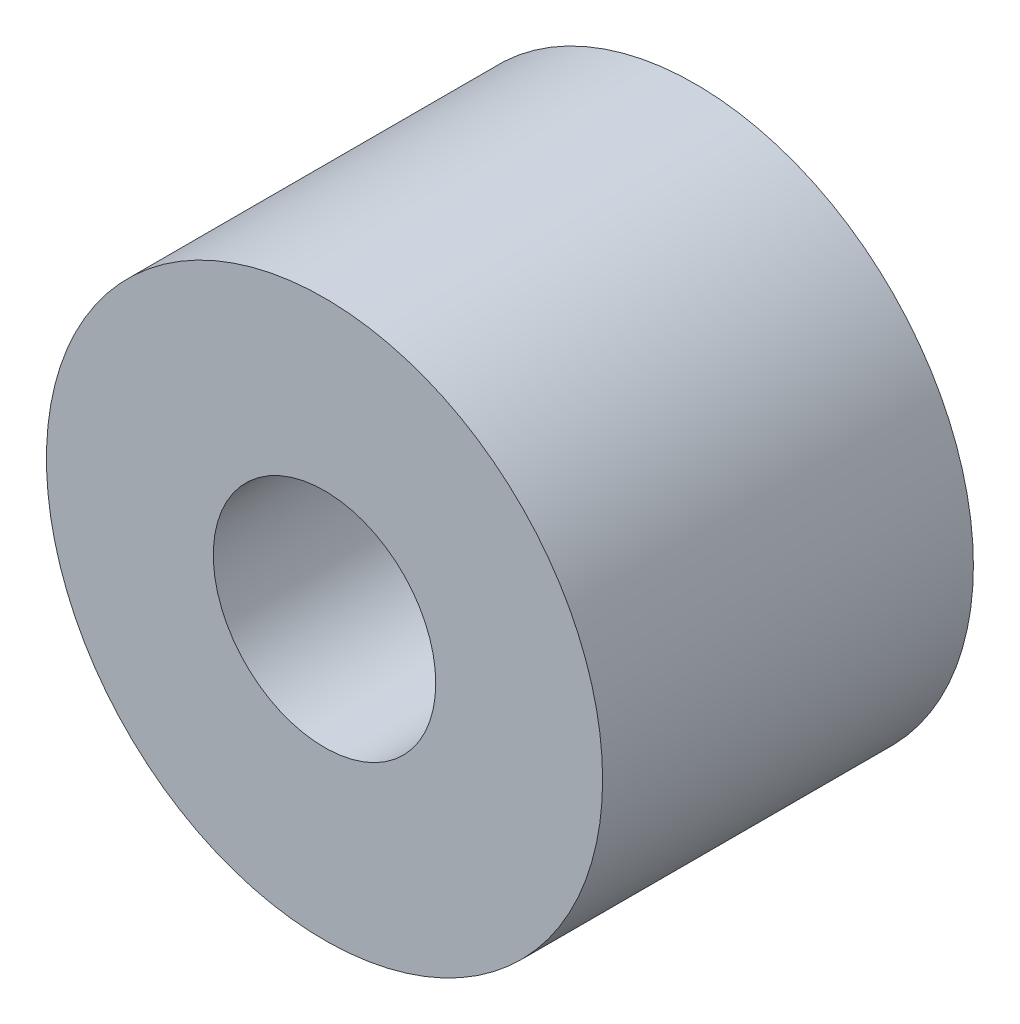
ISO-10303-21;
HEADER;
FILE_DESCRIPTION(('STEP AP214'),'2;1');
FILE_NAME('part.step','',(''),(''),'','','');
FILE_SCHEMA(('AUTOMOTIVE_DESIGN { 1 0 10303 214 1 1 1 1 }'));
ENDSEC;
DATA;
#1=APPLICATION_CONTEXT('core data for automotive mechanical design processes');
#2=APPLICATION_PROTOCOL_DEFINITION('international standard','automotive_design',2000,#1);
#3=PRODUCT_CONTEXT('',#1,'mechanical');
#4=PRODUCT('Part','Part','',(#3));
#5=PRODUCT_RELATED_PRODUCT_CATEGORY('part','',(#4));
#6=PRODUCT_DEFINITION_FORMATION('','',#4);
#7=PRODUCT_DEFINITION_CONTEXT('part definition',#1,'design');
#8=PRODUCT_DEFINITION('design','',#6,#7);
#9=PRODUCT_DEFINITION_SHAPE('','',#8);
#10=(LENGTH_UNIT() NAMED_UNIT(*) SI_UNIT(.MILLI.,.METRE.));
#11=(NAMED_UNIT(*) PLANE_ANGLE_UNIT() SI_UNIT($,.RADIAN.));
#12=(NAMED_UNIT(*) SI_UNIT($,.STERADIAN.) SOLID_ANGLE_UNIT());
#13=UNCERTAINTY_MEASURE_WITH_UNIT(LENGTH_MEASURE(1.E-05),#10,'distance_accuracy_value','');
#14=(GEOMETRIC_REPRESENTATION_CONTEXT(3) GLOBAL_UNCERTAINTY_ASSIGNED_CONTEXT((#13)) GLOBAL_UNIT_ASSIGNED_CONTEXT((#10,
#11,#12)) REPRESENTATION_CONTEXT('',''));
#15=CARTESIAN_POINT('',(0.,0.,0.));
#16=DIRECTION('',(0.,0.,1.));
#17=DIRECTION('',(1.,0.,0.));
#18=AXIS2_PLACEMENT_3D('',#15,#16,#17);
#19=CARTESIAN_POINT('',(0.,0.,-12.7));
#20=DIRECTION('',(0.,0.,1.));
#21=DIRECTION('',(1.,0.,0.));
#22=AXIS2_PLACEMENT_3D('',#19,#20,#21);
#23=CYLINDRICAL_SURFACE('',#22,9.52500000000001);
#24=CARTESIAN_POINT('',(0.,0.,-12.7));
#25=DIRECTION('',(0.,0.,1.));
#26=DIRECTION('',(1.,0.,0.));
#27=AXIS2_PLACEMENT_3D('',#24,#25,#26);
#28=CIRCLE('',#27,9.52500000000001);
#29=CARTESIAN_POINT('',(9.52500000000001,0.,-12.7));
#30=VERTEX_POINT('',#29);
#31=EDGE_CURVE('E10',#30,#30,#28,.T.);
#32=ORIENTED_EDGE('',*,*,#31,.T.);
#33=EDGE_LOOP('',(#32));
#34=FACE_BOUND('',#33,.T.);
#35=CARTESIAN_POINT('',(0.,0.,0.));
#36=DIRECTION('',(0.,0.,1.));
#37=DIRECTION('',(1.,0.,0.));
#38=AXIS2_PLACEMENT_3D('',#35,#36,#37);
#39=CIRCLE('',#38,9.52500000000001);
#40=CARTESIAN_POINT('',(9.52500000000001,0.,0.));
#41=VERTEX_POINT('',#40);
#42=EDGE_CURVE('E35',#41,#41,#39,.T.);
#43=ORIENTED_EDGE('',*,*,#42,.F.);
#44=EDGE_LOOP('',(#43));
#45=FACE_BOUND('',#44,.T.);
#46=ADVANCED_FACE('F32',(#34,#45),#23,.T.);
#47=CARTESIAN_POINT('',(0.,0.,-12.7));
#48=DIRECTION('',(0.,0.,1.));
#49=DIRECTION('',(1.,0.,0.));
#50=AXIS2_PLACEMENT_3D('',#47,#48,#49);
#51=PLANE('',#50);
#52=CARTESIAN_POINT('',(0.,0.,-12.7));
#53=DIRECTION('',(0.,0.,1.));
#54=DIRECTION('',(1.,0.,0.));
#55=AXIS2_PLACEMENT_3D('',#52,#53,#54);
#56=CIRCLE('',#55,3.81);
#57=CARTESIAN_POINT('',(3.81,0.,-12.7));
#58=VERTEX_POINT('',#57);
#59=EDGE_CURVE('E42',#58,#58,#56,.T.);
#60=ORIENTED_EDGE('',*,*,#59,.T.);
#61=EDGE_LOOP('',(#60));
#62=FACE_BOUND('',#61,.T.);
#63=ORIENTED_EDGE('',*,*,#31,.F.);
#64=EDGE_LOOP('',(#63));
#65=FACE_BOUND('',#64,.T.);
#66=ADVANCED_FACE('F50',(#62,#65),#51,.F.);
#67=CARTESIAN_POINT('',(0.,0.,0.));
#68=DIRECTION('',(0.,0.,1.));
#69=DIRECTION('',(1.,0.,0.));
#70=AXIS2_PLACEMENT_3D('',#67,#68,#69);
#71=PLANE('',#70);
#72=CARTESIAN_POINT('',(0.,0.,0.));
#73=DIRECTION('',(0.,0.,1.));
#74=DIRECTION('',(1.,0.,0.));
#75=AXIS2_PLACEMENT_3D('',#72,#73,#74);
#76=CIRCLE('',#75,3.81);
#77=CARTESIAN_POINT('',(3.81,0.,0.));
#78=VERTEX_POINT('',#77);
#79=EDGE_CURVE('E44',#78,#78,#76,.T.);
#80=ORIENTED_EDGE('',*,*,#79,.F.);
#81=EDGE_LOOP('',(#80));
#82=FACE_BOUND('',#81,.T.);
#83=ORIENTED_EDGE('',*,*,#42,.T.);
#84=EDGE_LOOP('',(#83));
#85=FACE_BOUND('',#84,.T.);
#86=ADVANCED_FACE('F56',(#82,#85),#71,.T.);
#87=CARTESIAN_POINT('',(0.,0.,-12.7));
#88=DIRECTION('',(0.,0.,1.));
#89=DIRECTION('',(1.,0.,0.));
#90=AXIS2_PLACEMENT_3D('',#87,#88,#89);
#91=CYLINDRICAL_SURFACE('',#90,3.81);
#92=ORIENTED_EDGE('',*,*,#59,.F.);
#93=EDGE_LOOP('',(#92));
#94=FACE_BOUND('',#93,.T.);
#95=ORIENTED_EDGE('',*,*,#79,.T.);
#96=EDGE_LOOP('',(#95));
#97=FACE_BOUND('',#96,.T.);
#98=ADVANCED_FACE('F53',(#94,#97),#91,.F.);
#99=CLOSED_SHELL('',(#46,#66,#86,#98));
#100=MANIFOLD_SOLID_BREP('B2',#99);
#101=ADVANCED_BREP_SHAPE_REPRESENTATION('',(#18,#100),#14);
#102=SHAPE_DEFINITION_REPRESENTATION(#9,#101);
ENDSEC;
END-ISO-10303-21;
